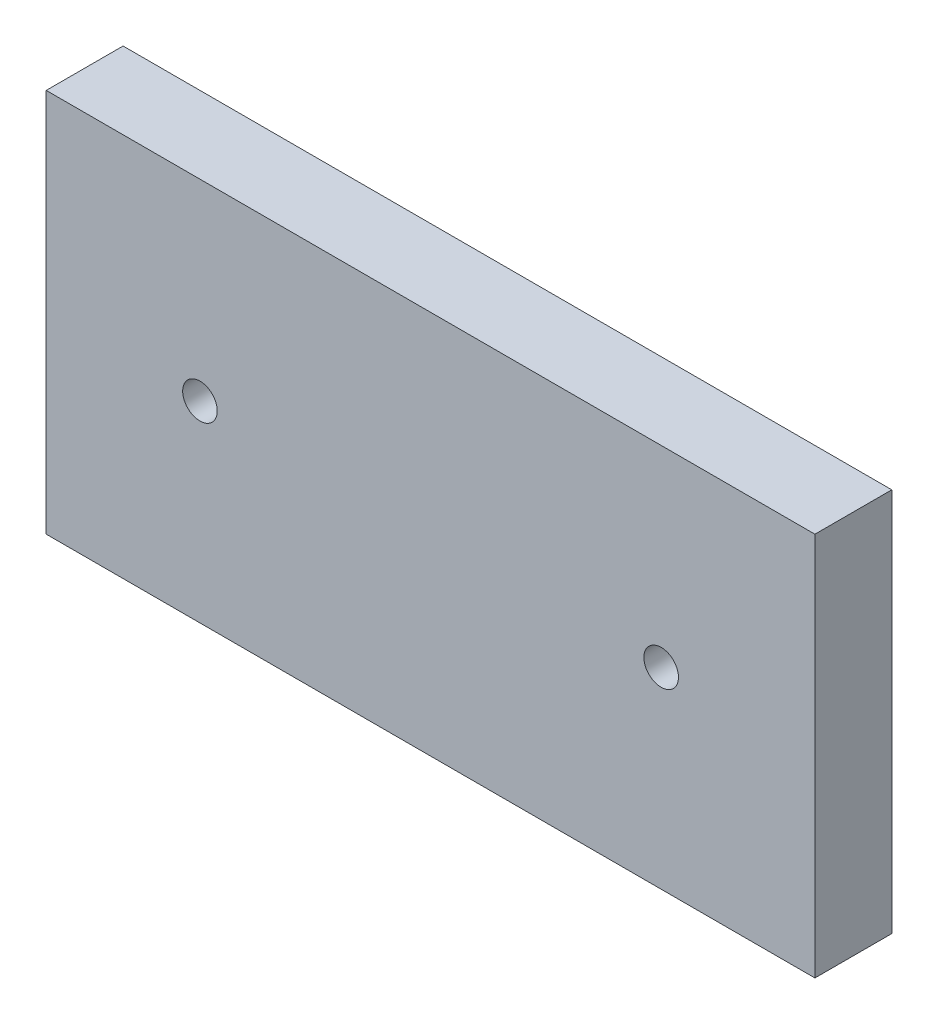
ISO-10303-21;
HEADER;
FILE_DESCRIPTION(('STEP AP214'),'2;1');
FILE_NAME('part.step','',(''),(''),'','','');
FILE_SCHEMA(('AUTOMOTIVE_DESIGN { 1 0 10303 214 1 1 1 1 }'));
ENDSEC;
DATA;
#1=APPLICATION_CONTEXT('core data for automotive mechanical design processes');
#2=APPLICATION_PROTOCOL_DEFINITION('international standard','automotive_design',2000,#1);
#3=PRODUCT_CONTEXT('',#1,'mechanical');
#4=PRODUCT('Part','Part','',(#3));
#5=PRODUCT_RELATED_PRODUCT_CATEGORY('part','',(#4));
#6=PRODUCT_DEFINITION_FORMATION('','',#4);
#7=PRODUCT_DEFINITION_CONTEXT('part definition',#1,'design');
#8=PRODUCT_DEFINITION('design','',#6,#7);
#9=PRODUCT_DEFINITION_SHAPE('','',#8);
#10=(LENGTH_UNIT() NAMED_UNIT(*) SI_UNIT(.MILLI.,.METRE.));
#11=(NAMED_UNIT(*) PLANE_ANGLE_UNIT() SI_UNIT($,.RADIAN.));
#12=(NAMED_UNIT(*) SI_UNIT($,.STERADIAN.) SOLID_ANGLE_UNIT());
#13=UNCERTAINTY_MEASURE_WITH_UNIT(LENGTH_MEASURE(1.E-05),#10,'distance_accuracy_value','');
#14=(GEOMETRIC_REPRESENTATION_CONTEXT(3) GLOBAL_UNCERTAINTY_ASSIGNED_CONTEXT((#13)) GLOBAL_UNIT_ASSIGNED_CONTEXT((#10,
#11,#12)) REPRESENTATION_CONTEXT('',''));
#15=CARTESIAN_POINT('',(0.,0.,0.));
#16=DIRECTION('',(0.,0.,1.));
#17=DIRECTION('',(1.,0.,0.));
#18=AXIS2_PLACEMENT_3D('',#15,#16,#17);
#19=CARTESIAN_POINT('',(-50.,25.,10.));
#20=DIRECTION('',(1.,0.,0.));
#21=DIRECTION('',(0.,1.,0.));
#22=AXIS2_PLACEMENT_3D('',#19,#20,#21);
#23=PLANE('',#22);
#24=DIRECTION('',(0.,-1.,0.));
#25=VECTOR('',#24,1.);
#26=CARTESIAN_POINT('',(-50.,25.,0.));
#27=LINE('',#26,#25);
#28=CARTESIAN_POINT('',(-50.,25.,0.));
#29=VERTEX_POINT('',#28);
#30=CARTESIAN_POINT('',(-50.,-25.,0.));
#31=VERTEX_POINT('',#30);
#32=EDGE_CURVE('E98',#29,#31,#27,.T.);
#33=ORIENTED_EDGE('',*,*,#32,.T.);
#34=DIRECTION('',(0.,0.,-1.));
#35=VECTOR('',#34,1.);
#36=CARTESIAN_POINT('',(-50.,-25.,10.));
#37=LINE('',#36,#35);
#38=CARTESIAN_POINT('',(-50.,-25.,10.));
#39=VERTEX_POINT('',#38);
#40=EDGE_CURVE('E11',#39,#31,#37,.T.);
#41=ORIENTED_EDGE('',*,*,#40,.F.);
#42=DIRECTION('',(0.,-1.,0.));
#43=VECTOR('',#42,1.);
#44=CARTESIAN_POINT('',(-50.,25.,10.));
#45=LINE('',#44,#43);
#46=CARTESIAN_POINT('',(-50.,25.,10.));
#47=VERTEX_POINT('',#46);
#48=EDGE_CURVE('E86',#47,#39,#45,.T.);
#49=ORIENTED_EDGE('',*,*,#48,.F.);
#50=DIRECTION('',(0.,0.,-1.));
#51=VECTOR('',#50,1.);
#52=CARTESIAN_POINT('',(-50.,25.,10.));
#53=LINE('',#52,#51);
#54=EDGE_CURVE('E94',#47,#29,#53,.T.);
#55=ORIENTED_EDGE('',*,*,#54,.T.);
#56=EDGE_LOOP('',(#33,#41,#49,#55));
#57=FACE_BOUND('',#56,.T.);
#58=ADVANCED_FACE('F35',(#57),#23,.F.);
#59=CARTESIAN_POINT('',(-50.,-25.,10.));
#60=DIRECTION('',(0.,1.,0.));
#61=DIRECTION('',(0.,0.,1.));
#62=AXIS2_PLACEMENT_3D('',#59,#60,#61);
#63=PLANE('',#62);
#64=DIRECTION('',(1.,0.,0.));
#65=VECTOR('',#64,1.);
#66=CARTESIAN_POINT('',(-50.,-25.,0.));
#67=LINE('',#66,#65);
#68=CARTESIAN_POINT('',(50.,-25.,0.));
#69=VERTEX_POINT('',#68);
#70=EDGE_CURVE('E90',#31,#69,#67,.T.);
#71=ORIENTED_EDGE('',*,*,#70,.T.);
#72=DIRECTION('',(0.,0.,-1.));
#73=VECTOR('',#72,1.);
#74=CARTESIAN_POINT('',(50.,-25.,10.));
#75=LINE('',#74,#73);
#76=CARTESIAN_POINT('',(50.,-25.,10.));
#77=VERTEX_POINT('',#76);
#78=EDGE_CURVE('E43',#77,#69,#75,.T.);
#79=ORIENTED_EDGE('',*,*,#78,.F.);
#80=DIRECTION('',(1.,0.,0.));
#81=VECTOR('',#80,1.);
#82=CARTESIAN_POINT('',(-50.,-25.,10.));
#83=LINE('',#82,#81);
#84=EDGE_CURVE('E81',#39,#77,#83,.T.);
#85=ORIENTED_EDGE('',*,*,#84,.F.);
#86=ORIENTED_EDGE('',*,*,#40,.T.);
#87=EDGE_LOOP('',(#71,#79,#85,#86));
#88=FACE_BOUND('',#87,.T.);
#89=ADVANCED_FACE('F89',(#88),#63,.F.);
#90=CARTESIAN_POINT('',(50.,25.,10.));
#91=DIRECTION('',(-1.,0.,0.));
#92=DIRECTION('',(0.,-1.,0.));
#93=AXIS2_PLACEMENT_3D('',#90,#91,#92);
#94=PLANE('',#93);
#95=DIRECTION('',(0.,1.,0.));
#96=VECTOR('',#95,1.);
#97=CARTESIAN_POINT('',(50.,25.,0.));
#98=LINE('',#97,#96);
#99=CARTESIAN_POINT('',(50.,25.,0.));
#100=VERTEX_POINT('',#99);
#101=EDGE_CURVE('E68',#69,#100,#98,.T.);
#102=ORIENTED_EDGE('',*,*,#101,.T.);
#103=DIRECTION('',(0.,0.,-1.));
#104=VECTOR('',#103,1.);
#105=CARTESIAN_POINT('',(50.,25.,10.));
#106=LINE('',#105,#104);
#107=CARTESIAN_POINT('',(50.,25.,10.));
#108=VERTEX_POINT('',#107);
#109=EDGE_CURVE('E91',#108,#100,#106,.T.);
#110=ORIENTED_EDGE('',*,*,#109,.F.);
#111=DIRECTION('',(0.,1.,0.));
#112=VECTOR('',#111,1.);
#113=CARTESIAN_POINT('',(50.,25.,10.));
#114=LINE('',#113,#112);
#115=EDGE_CURVE('E84',#77,#108,#114,.T.);
#116=ORIENTED_EDGE('',*,*,#115,.F.);
#117=ORIENTED_EDGE('',*,*,#78,.T.);
#118=EDGE_LOOP('',(#102,#110,#116,#117));
#119=FACE_BOUND('',#118,.T.);
#120=ADVANCED_FACE('F92',(#119),#94,.F.);
#121=CARTESIAN_POINT('',(-50.,25.,10.));
#122=DIRECTION('',(0.,-1.,0.));
#123=DIRECTION('',(0.,0.,-1.));
#124=AXIS2_PLACEMENT_3D('',#121,#122,#123);
#125=PLANE('',#124);
#126=DIRECTION('',(-1.,0.,0.));
#127=VECTOR('',#126,1.);
#128=CARTESIAN_POINT('',(-50.,25.,0.));
#129=LINE('',#128,#127);
#130=EDGE_CURVE('E74',#100,#29,#129,.T.);
#131=ORIENTED_EDGE('',*,*,#130,.T.);
#132=ORIENTED_EDGE('',*,*,#54,.F.);
#133=DIRECTION('',(-1.,0.,0.));
#134=VECTOR('',#133,1.);
#135=CARTESIAN_POINT('',(-50.,25.,10.));
#136=LINE('',#135,#134);
#137=EDGE_CURVE('E51',#108,#47,#136,.T.);
#138=ORIENTED_EDGE('',*,*,#137,.F.);
#139=ORIENTED_EDGE('',*,*,#109,.T.);
#140=EDGE_LOOP('',(#131,#132,#138,#139));
#141=FACE_BOUND('',#140,.T.);
#142=ADVANCED_FACE('F106',(#141),#125,.F.);
#143=CARTESIAN_POINT('',(-50.,-25.,10.));
#144=DIRECTION('',(0.,0.,1.));
#145=DIRECTION('',(1.,0.,0.));
#146=AXIS2_PLACEMENT_3D('',#143,#144,#145);
#147=PLANE('',#146);
#148=CARTESIAN_POINT('',(30.,0.,10.));
#149=DIRECTION('',(0.,0.,1.));
#150=DIRECTION('',(1.,0.,0.));
#151=AXIS2_PLACEMENT_3D('',#148,#149,#150);
#152=CIRCLE('',#151,2.25);
#153=CARTESIAN_POINT('',(32.25,0.,10.));
#154=VERTEX_POINT('',#153);
#155=EDGE_CURVE('E118',#154,#154,#152,.T.);
#156=ORIENTED_EDGE('',*,*,#155,.F.);
#157=EDGE_LOOP('',(#156));
#158=FACE_BOUND('',#157,.T.);
#159=CARTESIAN_POINT('',(-30.,0.,10.));
#160=DIRECTION('',(0.,0.,1.));
#161=DIRECTION('',(1.,0.,0.));
#162=AXIS2_PLACEMENT_3D('',#159,#160,#161);
#163=CIRCLE('',#162,2.25);
#164=CARTESIAN_POINT('',(-27.75,0.,10.));
#165=VERTEX_POINT('',#164);
#166=EDGE_CURVE('E112',#165,#165,#163,.T.);
#167=ORIENTED_EDGE('',*,*,#166,.F.);
#168=EDGE_LOOP('',(#167));
#169=FACE_BOUND('',#168,.T.);
#170=ORIENTED_EDGE('',*,*,#48,.T.);
#171=ORIENTED_EDGE('',*,*,#84,.T.);
#172=ORIENTED_EDGE('',*,*,#115,.T.);
#173=ORIENTED_EDGE('',*,*,#137,.T.);
#174=EDGE_LOOP('',(#170,#171,#172,#173));
#175=FACE_BOUND('',#174,.T.);
#176=ADVANCED_FACE('F82',(#158,#169,#175),#147,.T.);
#177=CARTESIAN_POINT('',(-50.,-25.,0.));
#178=DIRECTION('',(0.,0.,1.));
#179=DIRECTION('',(1.,0.,0.));
#180=AXIS2_PLACEMENT_3D('',#177,#178,#179);
#181=PLANE('',#180);
#182=CARTESIAN_POINT('',(30.,0.,0.));
#183=DIRECTION('',(0.,0.,1.));
#184=DIRECTION('',(1.,0.,0.));
#185=AXIS2_PLACEMENT_3D('',#182,#183,#184);
#186=CIRCLE('',#185,2.25);
#187=CARTESIAN_POINT('',(32.25,0.,0.));
#188=VERTEX_POINT('',#187);
#189=EDGE_CURVE('E115',#188,#188,#186,.T.);
#190=ORIENTED_EDGE('',*,*,#189,.T.);
#191=EDGE_LOOP('',(#190));
#192=FACE_BOUND('',#191,.T.);
#193=CARTESIAN_POINT('',(-30.,0.,0.));
#194=DIRECTION('',(0.,0.,1.));
#195=DIRECTION('',(1.,0.,0.));
#196=AXIS2_PLACEMENT_3D('',#193,#194,#195);
#197=CIRCLE('',#196,2.25);
#198=CARTESIAN_POINT('',(-27.75,0.,0.));
#199=VERTEX_POINT('',#198);
#200=EDGE_CURVE('E101',#199,#199,#197,.T.);
#201=ORIENTED_EDGE('',*,*,#200,.T.);
#202=EDGE_LOOP('',(#201));
#203=FACE_BOUND('',#202,.T.);
#204=ORIENTED_EDGE('',*,*,#32,.F.);
#205=ORIENTED_EDGE('',*,*,#130,.F.);
#206=ORIENTED_EDGE('',*,*,#101,.F.);
#207=ORIENTED_EDGE('',*,*,#70,.F.);
#208=EDGE_LOOP('',(#204,#205,#206,#207));
#209=FACE_BOUND('',#208,.T.);
#210=ADVANCED_FACE('F109',(#192,#203,#209),#181,.F.);
#211=CARTESIAN_POINT('',(-30.,0.,0.));
#212=DIRECTION('',(0.,0.,1.));
#213=DIRECTION('',(1.,0.,0.));
#214=AXIS2_PLACEMENT_3D('',#211,#212,#213);
#215=CYLINDRICAL_SURFACE('',#214,2.25);
#216=ORIENTED_EDGE('',*,*,#200,.F.);
#217=EDGE_LOOP('',(#216));
#218=FACE_BOUND('',#217,.T.);
#219=ORIENTED_EDGE('',*,*,#166,.T.);
#220=EDGE_LOOP('',(#219));
#221=FACE_BOUND('',#220,.T.);
#222=ADVANCED_FACE('F129',(#218,#221),#215,.F.);
#223=CARTESIAN_POINT('',(30.,0.,0.));
#224=DIRECTION('',(0.,0.,1.));
#225=DIRECTION('',(1.,0.,0.));
#226=AXIS2_PLACEMENT_3D('',#223,#224,#225);
#227=CYLINDRICAL_SURFACE('',#226,2.25);
#228=ORIENTED_EDGE('',*,*,#189,.F.);
#229=EDGE_LOOP('',(#228));
#230=FACE_BOUND('',#229,.T.);
#231=ORIENTED_EDGE('',*,*,#155,.T.);
#232=EDGE_LOOP('',(#231));
#233=FACE_BOUND('',#232,.T.);
#234=ADVANCED_FACE('F126',(#230,#233),#227,.F.);
#235=CLOSED_SHELL('',(#58,#89,#120,#142,#176,#210,#222,#234));
#236=MANIFOLD_SOLID_BREP('B2',#235);
#237=ADVANCED_BREP_SHAPE_REPRESENTATION('',(#18,#236),#14);
#238=SHAPE_DEFINITION_REPRESENTATION(#9,#237);
ENDSEC;
END-ISO-10303-21;
